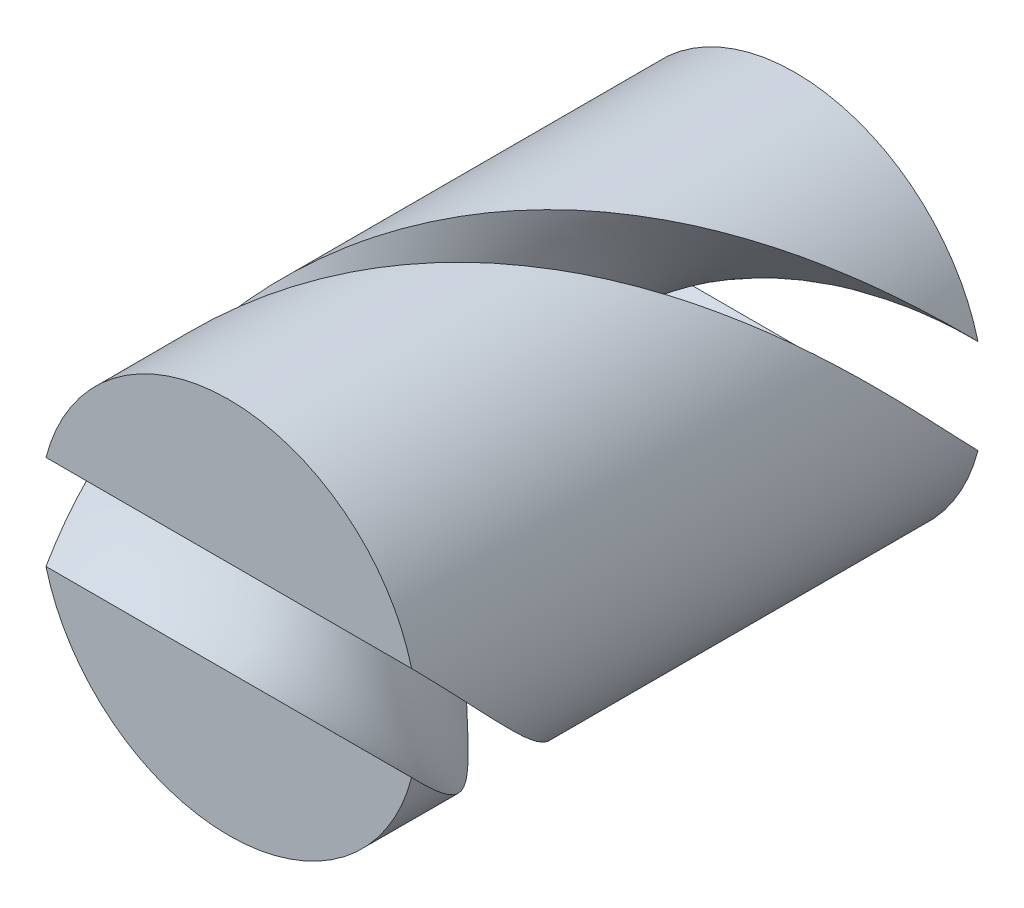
ISO-10303-21;
HEADER;
FILE_DESCRIPTION(('STEP AP214'),'2;1');
FILE_NAME('part.step','',(''),(''),'','','');
FILE_SCHEMA(('AUTOMOTIVE_DESIGN { 1 0 10303 214 1 1 1 1 }'));
ENDSEC;
DATA;
#1=APPLICATION_CONTEXT('core data for automotive mechanical design processes');
#2=APPLICATION_PROTOCOL_DEFINITION('international standard','automotive_design',2000,#1);
#3=PRODUCT_CONTEXT('',#1,'mechanical');
#4=PRODUCT('Part','Part','',(#3));
#5=PRODUCT_RELATED_PRODUCT_CATEGORY('part','',(#4));
#6=PRODUCT_DEFINITION_FORMATION('','',#4);
#7=PRODUCT_DEFINITION_CONTEXT('part definition',#1,'design');
#8=PRODUCT_DEFINITION('design','',#6,#7);
#9=PRODUCT_DEFINITION_SHAPE('','',#8);
#10=(LENGTH_UNIT() NAMED_UNIT(*) SI_UNIT(.MILLI.,.METRE.));
#11=(NAMED_UNIT(*) PLANE_ANGLE_UNIT() SI_UNIT($,.RADIAN.));
#12=(NAMED_UNIT(*) SI_UNIT($,.STERADIAN.) SOLID_ANGLE_UNIT());
#13=UNCERTAINTY_MEASURE_WITH_UNIT(LENGTH_MEASURE(1.E-05),#10,'distance_accuracy_value','');
#14=(GEOMETRIC_REPRESENTATION_CONTEXT(3) GLOBAL_UNCERTAINTY_ASSIGNED_CONTEXT((#13)) GLOBAL_UNIT_ASSIGNED_CONTEXT((#10,
#11,#12)) REPRESENTATION_CONTEXT('',''));
#15=CARTESIAN_POINT('',(0.,0.,0.));
#16=DIRECTION('',(0.,0.,1.));
#17=DIRECTION('',(1.,0.,0.));
#18=AXIS2_PLACEMENT_3D('',#15,#16,#17);
#19=CARTESIAN_POINT('',(0.,0.,150.));
#20=DIRECTION('',(0.,0.,-1.));
#21=DIRECTION('',(-1.,0.,0.));
#22=AXIS2_PLACEMENT_3D('',#19,#20,#21);
#23=CYLINDRICAL_SURFACE('',#22,50.);
#24=CARTESIAN_POINT('',(48.4122918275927,-12.5,0.));
#25=CARTESIAN_POINT('',(50.2095205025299,-5.53936327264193,6.8181818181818));
#26=CARTESIAN_POINT('',(49.9729108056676,1.64565658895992,13.6363636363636));
#27=CARTESIAN_POINT('',(49.7363011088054,8.83067645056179,20.4545454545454));
#28=CARTESIAN_POINT('',(47.4850217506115,15.6579918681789,27.2727272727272));
#29=CARTESIAN_POINT('',(45.2337423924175,22.485307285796,34.090909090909));
#30=CARTESIAN_POINT('',(41.1501786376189,28.4018097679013,40.9090909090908));
#31=CARTESIAN_POINT('',(37.0666148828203,34.3183122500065,47.7272727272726));
#32=CARTESIAN_POINT('',(31.481592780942,38.8446819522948,54.5454545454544));
#33=CARTESIAN_POINT('',(25.8965706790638,43.3710516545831,61.3636363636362));
#34=CARTESIAN_POINT('',(19.2625555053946,46.1405890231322,68.181818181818));
#35=CARTESIAN_POINT('',(12.6285403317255,48.9101263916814,74.9999999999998));
#36=CARTESIAN_POINT('',(5.48298054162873,49.6984599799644,81.8181818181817));
#37=CARTESIAN_POINT('',(-1.66257924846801,50.4867935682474,88.6363636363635));
#38=CARTESIAN_POINT('',(-8.74079289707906,49.230057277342,95.4545454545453));
#39=CARTESIAN_POINT('',(-15.8190065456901,47.9733209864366,102.272727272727));
#40=CARTESIAN_POINT('',(-22.2564392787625,44.7733281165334,109.090909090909));
#41=CARTESIAN_POINT('',(-28.6938720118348,41.5733352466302,115.909090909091));
#42=CARTESIAN_POINT('',(-33.9690013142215,36.6893301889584,122.727272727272));
#43=CARTESIAN_POINT('',(-39.2441306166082,31.8053251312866,129.545454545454));
#44=CARTESIAN_POINT('',(-42.9295968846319,25.6329809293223,136.363636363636));
#45=CARTESIAN_POINT('',(-46.6150631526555,19.4606367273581,143.181818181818));
#46=CARTESIAN_POINT('',(-48.4122918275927,12.5,150.));
#47=CARTESIAN_POINT('',(-50.2095205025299,5.53936327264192,156.818181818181));
#48=CARTESIAN_POINT('',(-49.9729108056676,-1.64565658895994,163.636363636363));
#49=CARTESIAN_POINT('',(-49.7363011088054,-8.83067645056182,170.454545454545));
#50=CARTESIAN_POINT('',(-47.4850217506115,-15.6579918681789,177.272727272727));
#51=CARTESIAN_POINT('',(-45.2337423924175,-22.485307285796,184.090909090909));
#52=CARTESIAN_POINT('',(-41.1501786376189,-28.4018097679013,190.90909090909));
#53=CARTESIAN_POINT('',(-37.0666148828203,-34.3183122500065,197.727272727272));
#54=CARTESIAN_POINT('',(-31.481592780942,-38.8446819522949,204.545454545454));
#55=CARTESIAN_POINT('',(-25.8965706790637,-43.3710516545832,211.363636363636));
#56=CARTESIAN_POINT('',(-19.2625555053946,-46.1405890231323,218.181818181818));
#57=CARTESIAN_POINT('',(-12.6285403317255,-48.9101263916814,225.));
#58=CARTESIAN_POINT('',(-5.48298054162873,-49.6984599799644,231.818181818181));
#59=CARTESIAN_POINT('',(1.662579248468,-50.4867935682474,238.636363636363));
#60=CARTESIAN_POINT('',(8.74079289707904,-49.230057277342,245.454545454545));
#61=CARTESIAN_POINT('',(15.8190065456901,-47.9733209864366,252.272727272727));
#62=CARTESIAN_POINT('',(22.2564392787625,-44.7733281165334,259.090909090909));
#63=CARTESIAN_POINT('',(28.6938720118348,-41.5733352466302,265.90909090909));
#64=CARTESIAN_POINT('',(33.9690013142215,-36.6893301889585,272.727272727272));
#65=CARTESIAN_POINT('',(39.2441306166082,-31.8053251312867,279.545454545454));
#66=CARTESIAN_POINT('',(42.9295968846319,-25.6329809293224,286.363636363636));
#67=CARTESIAN_POINT('',(46.6150631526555,-19.4606367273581,293.181818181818));
#68=CARTESIAN_POINT('',(48.4122918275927,-12.5000000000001,299.999999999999));
#69=(BOUNDED_CURVE() B_SPLINE_CURVE(2,(#24,#25,#26,#27,#28,#29,#30,#31,#32,#33,#34,#35,#36,#37,
#38,#39,#40,#41,#42,#43,#44,#45,#46,#47,#48,#49,#50,#51,#52,#53,#54,#55,#56,#57,#58,#59,#60,#61,
#62,#63,#64,#65,#66,#67,#68),.UNSPECIFIED.,.F.,.F.) B_SPLINE_CURVE_WITH_KNOTS((3,2,2,2,2,2,2,2,
2,2,2,2,2,2,2,2,2,2,2,2,2,2,3),(0.,0.0454545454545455,0.0909090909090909,0.136363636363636,
0.181818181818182,0.227272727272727,0.272727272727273,0.318181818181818,0.363636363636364,
0.409090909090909,0.454545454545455,0.5,0.545454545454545,0.590909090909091,0.636363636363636,
0.681818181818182,0.727272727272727,0.772727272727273,0.818181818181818,0.863636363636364,
0.909090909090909,0.954545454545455,1.),
.UNSPECIFIED.) CURVE() GEOMETRIC_REPRESENTATION_ITEM() RATIONAL_B_SPLINE_CURVE((1.,
0.989821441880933,1.,0.989821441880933,1.,0.989821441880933,1.,0.989821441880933,1.,
0.989821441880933,1.,0.989821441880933,1.,0.989821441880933,1.,0.989821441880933,1.,
0.989821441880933,1.,0.989821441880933,1.,0.989821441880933,1.,0.989821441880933,1.,
0.989821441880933,1.,0.989821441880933,1.,0.989821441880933,1.,0.989821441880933,1.,
0.989821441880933,1.,0.989821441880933,1.,0.989821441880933,1.,0.989821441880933,1.,
0.989821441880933,1.,0.989821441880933,1.)) REPRESENTATION_ITEM(''));
#70=CARTESIAN_POINT('',(48.4122918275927,-12.5,0.));
#71=VERTEX_POINT('',#70);
#72=CARTESIAN_POINT('',(-48.4122918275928,12.4999999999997,150.));
#73=VERTEX_POINT('',#72);
#74=EDGE_CURVE('E56',#71,#73,#69,.T.);
#75=ORIENTED_EDGE('',*,*,#74,.T.);
#76=CARTESIAN_POINT('',(0.,0.,150.));
#77=DIRECTION('',(0.,0.,1.));
#78=DIRECTION('',(1.,0.,0.));
#79=AXIS2_PLACEMENT_3D('',#76,#77,#78);
#80=CIRCLE('',#79,50.);
#81=CARTESIAN_POINT('',(48.4122918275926,12.5000000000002,150.));
#82=VERTEX_POINT('',#81);
#83=EDGE_CURVE('E72',#82,#73,#80,.T.);
#84=ORIENTED_EDGE('',*,*,#83,.F.);
#85=CARTESIAN_POINT('',(-48.4122918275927,-12.5,0.));
#86=CARTESIAN_POINT('',(-46.6150631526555,-19.4606367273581,6.8181818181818));
#87=CARTESIAN_POINT('',(-42.9295968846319,-25.6329809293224,13.6363636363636));
#88=CARTESIAN_POINT('',(-39.2441306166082,-31.8053251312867,20.4545454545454));
#89=CARTESIAN_POINT('',(-33.9690013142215,-36.6893301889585,27.2727272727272));
#90=CARTESIAN_POINT('',(-28.6938720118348,-41.5733352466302,34.090909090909));
#91=CARTESIAN_POINT('',(-22.2564392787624,-44.7733281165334,40.9090909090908));
#92=CARTESIAN_POINT('',(-15.8190065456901,-47.9733209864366,47.7272727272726));
#93=CARTESIAN_POINT('',(-8.74079289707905,-49.230057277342,54.5454545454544));
#94=CARTESIAN_POINT('',(-1.662579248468,-50.4867935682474,61.3636363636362));
#95=CARTESIAN_POINT('',(5.48298054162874,-49.6984599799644,68.181818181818));
#96=CARTESIAN_POINT('',(12.6285403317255,-48.9101263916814,74.9999999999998));
#97=CARTESIAN_POINT('',(19.2625555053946,-46.1405890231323,81.8181818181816));
#98=CARTESIAN_POINT('',(25.8965706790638,-43.3710516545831,88.6363636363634));
#99=CARTESIAN_POINT('',(31.481592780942,-38.8446819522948,95.4545454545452));
#100=CARTESIAN_POINT('',(37.0666148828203,-34.3183122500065,102.272727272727));
#101=CARTESIAN_POINT('',(41.1501786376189,-28.4018097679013,109.090909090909));
#102=CARTESIAN_POINT('',(45.2337423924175,-22.485307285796,115.909090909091));
#103=CARTESIAN_POINT('',(47.4850217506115,-15.6579918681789,122.727272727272));
#104=CARTESIAN_POINT('',(49.7363011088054,-8.83067645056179,129.545454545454));
#105=CARTESIAN_POINT('',(49.9729108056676,-1.64565658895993,136.363636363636));
#106=CARTESIAN_POINT('',(50.2095205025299,5.53936327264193,143.181818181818));
#107=CARTESIAN_POINT('',(48.4122918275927,12.5,150.));
#108=CARTESIAN_POINT('',(46.6150631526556,19.4606367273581,156.818181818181));
#109=CARTESIAN_POINT('',(42.9295968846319,25.6329809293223,163.636363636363));
#110=CARTESIAN_POINT('',(39.2441306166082,31.8053251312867,170.454545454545));
#111=CARTESIAN_POINT('',(33.9690013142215,36.6893301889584,177.272727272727));
#112=CARTESIAN_POINT('',(28.6938720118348,41.5733352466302,184.090909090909));
#113=CARTESIAN_POINT('',(22.2564392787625,44.7733281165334,190.90909090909));
#114=CARTESIAN_POINT('',(15.8190065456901,47.9733209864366,197.727272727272));
#115=CARTESIAN_POINT('',(8.74079289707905,49.230057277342,204.545454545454));
#116=CARTESIAN_POINT('',(1.662579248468,50.4867935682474,211.363636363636));
#117=CARTESIAN_POINT('',(-5.48298054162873,49.6984599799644,218.181818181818));
#118=CARTESIAN_POINT('',(-12.6285403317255,48.9101263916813,225.));
#119=CARTESIAN_POINT('',(-19.2625555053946,46.1405890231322,231.818181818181));
#120=CARTESIAN_POINT('',(-25.8965706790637,43.3710516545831,238.636363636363));
#121=CARTESIAN_POINT('',(-31.481592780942,38.8446819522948,245.454545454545));
#122=CARTESIAN_POINT('',(-37.0666148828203,34.3183122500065,252.272727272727));
#123=CARTESIAN_POINT('',(-41.1501786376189,28.4018097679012,259.090909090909));
#124=CARTESIAN_POINT('',(-45.2337423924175,22.485307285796,265.90909090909));
#125=CARTESIAN_POINT('',(-47.4850217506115,15.6579918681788,272.727272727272));
#126=CARTESIAN_POINT('',(-49.7363011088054,8.83067645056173,279.545454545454));
#127=CARTESIAN_POINT('',(-49.9729108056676,1.64565658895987,286.363636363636));
#128=CARTESIAN_POINT('',(-50.2095205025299,-5.53936327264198,293.181818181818));
#129=CARTESIAN_POINT('',(-48.4122918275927,-12.5,299.999999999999));
#130=(BOUNDED_CURVE() B_SPLINE_CURVE(2,(#85,#86,#87,#88,#89,#90,#91,#92,#93,#94,#95,#96,#97,#98,
#99,#100,#101,#102,#103,#104,#105,#106,#107,#108,#109,#110,#111,#112,#113,#114,#115,#116,#117,
#118,#119,#120,#121,#122,#123,#124,#125,#126,#127,#128,#129),.UNSPECIFIED.,.F.,
.F.) B_SPLINE_CURVE_WITH_KNOTS((3,2,2,2,2,2,2,2,2,2,2,2,2,2,2,2,2,2,2,2,2,2,3),(0.,
0.0454545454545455,0.0909090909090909,0.136363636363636,0.181818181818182,0.227272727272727,
0.272727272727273,0.318181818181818,0.363636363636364,0.409090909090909,0.454545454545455,0.5,
0.545454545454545,0.590909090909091,0.636363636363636,0.681818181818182,0.727272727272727,
0.772727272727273,0.818181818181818,0.863636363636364,0.909090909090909,0.954545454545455,1.),
.UNSPECIFIED.) CURVE() GEOMETRIC_REPRESENTATION_ITEM() RATIONAL_B_SPLINE_CURVE((1.,
0.989821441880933,1.,0.989821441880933,1.,0.989821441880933,1.,0.989821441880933,1.,
0.989821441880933,1.,0.989821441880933,1.,0.989821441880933,1.,0.989821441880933,1.,
0.989821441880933,1.,0.989821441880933,1.,0.989821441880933,1.,0.989821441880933,1.,
0.989821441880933,1.,0.989821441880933,1.,0.989821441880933,1.,0.989821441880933,1.,
0.989821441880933,1.,0.989821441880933,1.,0.989821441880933,1.,0.989821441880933,1.,
0.989821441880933,1.,0.989821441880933,1.)) REPRESENTATION_ITEM(''));
#131=CARTESIAN_POINT('',(-48.4122918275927,-12.5,0.));
#132=VERTEX_POINT('',#131);
#133=EDGE_CURVE('E44',#132,#82,#130,.T.);
#134=ORIENTED_EDGE('',*,*,#133,.F.);
#135=CARTESIAN_POINT('',(0.,0.,0.));
#136=DIRECTION('',(0.,0.,1.));
#137=DIRECTION('',(1.,0.,0.));
#138=AXIS2_PLACEMENT_3D('',#135,#136,#137);
#139=CIRCLE('',#138,50.);
#140=EDGE_CURVE('E76',#132,#71,#139,.T.);
#141=ORIENTED_EDGE('',*,*,#140,.T.);
#142=EDGE_LOOP('',(#75,#84,#134,#141));
#143=FACE_BOUND('',#142,.T.);
#144=ADVANCED_FACE('F36',(#143),#23,.T.);
#145=CARTESIAN_POINT('',(0.,0.,150.));
#146=DIRECTION('',(0.,0.,1.));
#147=DIRECTION('',(1.,0.,0.));
#148=AXIS2_PLACEMENT_3D('',#145,#146,#147);
#149=PLANE('',#148);
#150=ORIENTED_EDGE('',*,*,#83,.T.);
#151=DIRECTION('',(1.,0.,0.));
#152=VECTOR('',#151,1.);
#153=CARTESIAN_POINT('',(-48.4122918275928,12.4999999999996,150.));
#154=LINE('',#153,#152);
#155=EDGE_CURVE('E61',#73,#82,#154,.T.);
#156=ORIENTED_EDGE('',*,*,#155,.T.);
#157=EDGE_LOOP('',(#150,#156));
#158=FACE_BOUND('',#157,.T.);
#159=ADVANCED_FACE('F71',(#158),#149,.T.);
#160=CARTESIAN_POINT('',(0.,0.,0.));
#161=DIRECTION('',(0.,0.,1.));
#162=DIRECTION('',(1.,0.,0.));
#163=AXIS2_PLACEMENT_3D('',#160,#161,#162);
#164=PLANE('',#163);
#165=DIRECTION('',(-1.,0.,0.));
#166=VECTOR('',#165,1.);
#167=CARTESIAN_POINT('',(48.4122918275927,-12.5,0.));
#168=LINE('',#167,#166);
#169=EDGE_CURVE('E12',#71,#132,#168,.T.);
#170=ORIENTED_EDGE('',*,*,#169,.F.);
#171=ORIENTED_EDGE('',*,*,#140,.F.);
#172=EDGE_LOOP('',(#170,#171));
#173=FACE_BOUND('',#172,.T.);
#174=ADVANCED_FACE('F110',(#173),#164,.F.);
#175=CARTESIAN_POINT('',(48.4122918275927,-12.5,0.));
#176=CARTESIAN_POINT('',(50.2095205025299,-5.53936327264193,6.8181818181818));
#177=CARTESIAN_POINT('',(49.9729108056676,1.64565658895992,13.6363636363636));
#178=CARTESIAN_POINT('',(49.7363011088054,8.83067645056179,20.4545454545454));
#179=CARTESIAN_POINT('',(47.4850217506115,15.6579918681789,27.2727272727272));
#180=CARTESIAN_POINT('',(45.2337423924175,22.485307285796,34.090909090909));
#181=CARTESIAN_POINT('',(41.1501786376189,28.4018097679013,40.9090909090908));
#182=CARTESIAN_POINT('',(37.0666148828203,34.3183122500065,47.7272727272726));
#183=CARTESIAN_POINT('',(31.481592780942,38.8446819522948,54.5454545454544));
#184=CARTESIAN_POINT('',(25.8965706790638,43.3710516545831,61.3636363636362));
#185=CARTESIAN_POINT('',(19.2625555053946,46.1405890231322,68.181818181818));
#186=CARTESIAN_POINT('',(12.6285403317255,48.9101263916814,74.9999999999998));
#187=CARTESIAN_POINT('',(5.48298054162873,49.6984599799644,81.8181818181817));
#188=CARTESIAN_POINT('',(-1.66257924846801,50.4867935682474,88.6363636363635));
#189=CARTESIAN_POINT('',(-8.74079289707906,49.230057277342,95.4545454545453));
#190=CARTESIAN_POINT('',(-15.8190065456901,47.9733209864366,102.272727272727));
#191=CARTESIAN_POINT('',(-22.2564392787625,44.7733281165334,109.090909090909));
#192=CARTESIAN_POINT('',(-28.6938720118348,41.5733352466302,115.909090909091));
#193=CARTESIAN_POINT('',(-33.9690013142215,36.6893301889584,122.727272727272));
#194=CARTESIAN_POINT('',(-39.2441306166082,31.8053251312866,129.545454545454));
#195=CARTESIAN_POINT('',(-42.9295968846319,25.6329809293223,136.363636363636));
#196=CARTESIAN_POINT('',(-46.6150631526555,19.4606367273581,143.181818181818));
#197=CARTESIAN_POINT('',(-48.4122918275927,12.5,150.));
#198=CARTESIAN_POINT('',(-50.2095205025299,5.53936327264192,156.818181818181));
#199=CARTESIAN_POINT('',(-49.9729108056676,-1.64565658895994,163.636363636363));
#200=CARTESIAN_POINT('',(-49.7363011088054,-8.83067645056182,170.454545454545));
#201=CARTESIAN_POINT('',(-47.4850217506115,-15.6579918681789,177.272727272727));
#202=CARTESIAN_POINT('',(-45.2337423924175,-22.485307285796,184.090909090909));
#203=CARTESIAN_POINT('',(-41.1501786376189,-28.4018097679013,190.90909090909));
#204=CARTESIAN_POINT('',(-37.0666148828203,-34.3183122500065,197.727272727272));
#205=CARTESIAN_POINT('',(-31.481592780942,-38.8446819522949,204.545454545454));
#206=CARTESIAN_POINT('',(-25.8965706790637,-43.3710516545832,211.363636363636));
#207=CARTESIAN_POINT('',(-19.2625555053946,-46.1405890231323,218.181818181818));
#208=CARTESIAN_POINT('',(-12.6285403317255,-48.9101263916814,225.));
#209=CARTESIAN_POINT('',(-5.48298054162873,-49.6984599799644,231.818181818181));
#210=CARTESIAN_POINT('',(1.662579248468,-50.4867935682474,238.636363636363));
#211=CARTESIAN_POINT('',(8.74079289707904,-49.230057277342,245.454545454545));
#212=CARTESIAN_POINT('',(15.8190065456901,-47.9733209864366,252.272727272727));
#213=CARTESIAN_POINT('',(22.2564392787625,-44.7733281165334,259.090909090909));
#214=CARTESIAN_POINT('',(28.6938720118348,-41.5733352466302,265.90909090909));
#215=CARTESIAN_POINT('',(33.9690013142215,-36.6893301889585,272.727272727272));
#216=CARTESIAN_POINT('',(39.2441306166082,-31.8053251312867,279.545454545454));
#217=CARTESIAN_POINT('',(42.9295968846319,-25.6329809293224,286.363636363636));
#218=CARTESIAN_POINT('',(46.6150631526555,-19.4606367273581,293.181818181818));
#219=CARTESIAN_POINT('',(48.4122918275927,-12.5,299.999999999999));
#220=CARTESIAN_POINT('',(-48.4122918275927,-12.5,0.));
#221=CARTESIAN_POINT('',(-46.6150631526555,-19.4606367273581,6.8181818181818));
#222=CARTESIAN_POINT('',(-42.9295968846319,-25.6329809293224,13.6363636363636));
#223=CARTESIAN_POINT('',(-39.2441306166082,-31.8053251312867,20.4545454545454));
#224=CARTESIAN_POINT('',(-33.9690013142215,-36.6893301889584,27.2727272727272));
#225=CARTESIAN_POINT('',(-28.6938720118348,-41.5733352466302,34.090909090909));
#226=CARTESIAN_POINT('',(-22.2564392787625,-44.7733281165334,40.9090909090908));
#227=CARTESIAN_POINT('',(-15.8190065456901,-47.9733209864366,47.7272727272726));
#228=CARTESIAN_POINT('',(-8.74079289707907,-49.230057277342,54.5454545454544));
#229=CARTESIAN_POINT('',(-1.66257924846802,-50.4867935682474,61.3636363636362));
#230=CARTESIAN_POINT('',(5.48298054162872,-49.6984599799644,68.181818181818));
#231=CARTESIAN_POINT('',(12.6285403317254,-48.9101263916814,74.9999999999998));
#232=CARTESIAN_POINT('',(19.2625555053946,-46.1405890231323,81.8181818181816));
#233=CARTESIAN_POINT('',(25.8965706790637,-43.3710516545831,88.6363636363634));
#234=CARTESIAN_POINT('',(31.481592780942,-38.8446819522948,95.4545454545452));
#235=CARTESIAN_POINT('',(37.0666148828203,-34.3183122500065,102.272727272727));
#236=CARTESIAN_POINT('',(41.1501786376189,-28.4018097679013,109.090909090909));
#237=CARTESIAN_POINT('',(45.2337423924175,-22.4853072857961,115.909090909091));
#238=CARTESIAN_POINT('',(47.4850217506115,-15.6579918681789,122.727272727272));
#239=CARTESIAN_POINT('',(49.7363011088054,-8.8306764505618,129.545454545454));
#240=CARTESIAN_POINT('',(49.9729108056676,-1.64565658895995,136.363636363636));
#241=CARTESIAN_POINT('',(50.2095205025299,5.53936327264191,143.181818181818));
#242=CARTESIAN_POINT('',(48.4122918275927,12.5,150.));
#243=CARTESIAN_POINT('',(46.6150631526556,19.460636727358,156.818181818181));
#244=CARTESIAN_POINT('',(42.9295968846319,25.6329809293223,163.636363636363));
#245=CARTESIAN_POINT('',(39.2441306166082,31.8053251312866,170.454545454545));
#246=CARTESIAN_POINT('',(33.9690013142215,36.6893301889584,177.272727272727));
#247=CARTESIAN_POINT('',(28.6938720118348,41.5733352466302,184.090909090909));
#248=CARTESIAN_POINT('',(22.2564392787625,44.7733281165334,190.90909090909));
#249=CARTESIAN_POINT('',(15.8190065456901,47.9733209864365,197.727272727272));
#250=CARTESIAN_POINT('',(8.74079289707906,49.230057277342,204.545454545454));
#251=CARTESIAN_POINT('',(1.66257924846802,50.4867935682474,211.363636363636));
#252=CARTESIAN_POINT('',(-5.48298054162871,49.6984599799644,218.181818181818));
#253=CARTESIAN_POINT('',(-12.6285403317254,48.9101263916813,225.));
#254=CARTESIAN_POINT('',(-19.2625555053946,46.1405890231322,231.818181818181));
#255=CARTESIAN_POINT('',(-25.8965706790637,43.3710516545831,238.636363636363));
#256=CARTESIAN_POINT('',(-31.481592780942,38.8446819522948,245.454545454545));
#257=CARTESIAN_POINT('',(-37.0666148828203,34.3183122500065,252.272727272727));
#258=CARTESIAN_POINT('',(-41.1501786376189,28.4018097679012,259.090909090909));
#259=CARTESIAN_POINT('',(-45.2337423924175,22.485307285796,265.90909090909));
#260=CARTESIAN_POINT('',(-47.4850217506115,15.6579918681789,272.727272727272));
#261=CARTESIAN_POINT('',(-49.7363011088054,8.83067645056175,279.545454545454));
#262=CARTESIAN_POINT('',(-49.9729108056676,1.64565658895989,286.363636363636));
#263=CARTESIAN_POINT('',(-50.2095205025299,-5.53936327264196,293.181818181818));
#264=CARTESIAN_POINT('',(-48.4122918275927,-12.5,299.999999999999));
#265=(BOUNDED_SURFACE() B_SPLINE_SURFACE(1,2,((#175,#176,#177,#178,#179,#180,#181,#182,#183,
#184,#185,#186,#187,#188,#189,#190,#191,#192,#193,#194,#195,#196,#197,#198,#199,#200,#201,#202,
#203,#204,#205,#206,#207,#208,#209,#210,#211,#212,#213,#214,#215,#216,#217,#218,#219),(#220,
#221,#222,#223,#224,#225,#226,#227,#228,#229,#230,#231,#232,#233,#234,#235,#236,#237,#238,#239,
#240,#241,#242,#243,#244,#245,#246,#247,#248,#249,#250,#251,#252,#253,#254,#255,#256,#257,#258,
#259,#260,#261,#262,#263,#264)),.UNSPECIFIED.,.F.,.F.,.F.) B_SPLINE_SURFACE_WITH_KNOTS((2,2),(3,
2,2,2,2,2,2,2,2,2,2,2,2,2,2,2,2,2,2,2,2,2,3),(0.,1.),(0.,0.0454545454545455,0.0909090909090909,
0.136363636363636,0.181818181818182,0.227272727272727,0.272727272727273,0.318181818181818,
0.363636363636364,0.409090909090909,0.454545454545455,0.5,0.545454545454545,0.590909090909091,
0.636363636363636,0.681818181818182,0.727272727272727,0.772727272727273,0.818181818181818,
0.863636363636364,0.909090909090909,0.954545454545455,1.),
.UNSPECIFIED.) GEOMETRIC_REPRESENTATION_ITEM() RATIONAL_B_SPLINE_SURFACE(((1.,0.989821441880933,
1.,0.989821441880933,1.,0.989821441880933,1.,0.989821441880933,1.,0.989821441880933,1.,
0.989821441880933,1.,0.989821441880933,1.,0.989821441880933,1.,0.989821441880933,1.,
0.989821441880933,1.,0.989821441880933,1.,0.989821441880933,1.,0.989821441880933,1.,
0.989821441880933,1.,0.989821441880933,1.,0.989821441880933,1.,0.989821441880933,1.,
0.989821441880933,1.,0.989821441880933,1.,0.989821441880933,1.,0.989821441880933,1.,
0.989821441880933,1.),(1.,0.989821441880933,1.,0.989821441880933,1.,0.989821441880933,1.,
0.989821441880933,1.,0.989821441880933,1.,0.989821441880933,1.,0.989821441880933,1.,
0.989821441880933,1.,0.989821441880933,1.,0.989821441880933,1.,0.989821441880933,1.,
0.989821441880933,1.,0.989821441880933,1.,0.989821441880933,1.,0.989821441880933,1.,
0.989821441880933,1.,0.989821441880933,1.,0.989821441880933,1.,0.989821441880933,1.,
0.989821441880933,1.,0.989821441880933,1.,0.989821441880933,1.))) REPRESENTATION_ITEM('') SURFACE());
#266=ORIENTED_EDGE('',*,*,#133,.T.);
#267=ORIENTED_EDGE('',*,*,#155,.F.);
#268=ORIENTED_EDGE('',*,*,#74,.F.);
#269=ORIENTED_EDGE('',*,*,#169,.T.);
#270=EDGE_LOOP('',(#266,#267,#268,#269));
#271=FACE_BOUND('',#270,.T.);
#272=ADVANCED_FACE('F60',(#271),#265,.T.);
#273=CLOSED_SHELL('',(#144,#159,#174,#272));
#274=MANIFOLD_SOLID_BREP('B2',#273);
#275=CARTESIAN_POINT('',(0.,0.,0.));
#276=DIRECTION('',(0.,0.,1.));
#277=DIRECTION('',(1.,0.,0.));
#278=AXIS2_PLACEMENT_3D('',#275,#276,#277);
#279=PLANE('',#278);
#280=DIRECTION('',(1.,0.,0.));
#281=VECTOR('',#280,1.);
#282=CARTESIAN_POINT('',(48.4122918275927,12.5,0.));
#283=LINE('',#282,#281);
#284=CARTESIAN_POINT('',(-48.4122918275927,12.5,0.));
#285=VERTEX_POINT('',#284);
#286=CARTESIAN_POINT('',(48.4122918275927,12.5,0.));
#287=VERTEX_POINT('',#286);
#288=EDGE_CURVE('E175',#285,#287,#283,.T.);
#289=ORIENTED_EDGE('',*,*,#288,.F.);
#290=CARTESIAN_POINT('',(0.,0.,0.));
#291=DIRECTION('',(0.,0.,1.));
#292=DIRECTION('',(1.,0.,0.));
#293=AXIS2_PLACEMENT_3D('',#290,#291,#292);
#294=CIRCLE('',#293,50.);
#295=EDGE_CURVE('E158',#287,#285,#294,.T.);
#296=ORIENTED_EDGE('',*,*,#295,.F.);
#297=EDGE_LOOP('',(#289,#296));
#298=FACE_BOUND('',#297,.T.);
#299=ADVANCED_FACE('F148',(#298),#279,.F.);
#300=CARTESIAN_POINT('',(0.,0.,150.));
#301=DIRECTION('',(0.,0.,1.));
#302=DIRECTION('',(1.,0.,0.));
#303=AXIS2_PLACEMENT_3D('',#300,#301,#302);
#304=PLANE('',#303);
#305=CARTESIAN_POINT('',(0.,0.,150.));
#306=DIRECTION('',(0.,0.,1.));
#307=DIRECTION('',(1.,0.,0.));
#308=AXIS2_PLACEMENT_3D('',#305,#306,#307);
#309=CIRCLE('',#308,50.);
#310=CARTESIAN_POINT('',(-48.4122918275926,-12.5000000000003,150.));
#311=VERTEX_POINT('',#310);
#312=CARTESIAN_POINT('',(48.4122918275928,-12.4999999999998,150.));
#313=VERTEX_POINT('',#312);
#314=EDGE_CURVE('E34',#311,#313,#309,.T.);
#315=ORIENTED_EDGE('',*,*,#314,.T.);
#316=DIRECTION('',(-1.,0.,0.));
#317=VECTOR('',#316,1.);
#318=CARTESIAN_POINT('',(-48.4122918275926,-12.5000000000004,150.));
#319=LINE('',#318,#317);
#320=EDGE_CURVE('E152',#313,#311,#319,.T.);
#321=ORIENTED_EDGE('',*,*,#320,.T.);
#322=EDGE_LOOP('',(#315,#321));
#323=FACE_BOUND('',#322,.T.);
#324=ADVANCED_FACE('F197',(#323),#304,.T.);
#325=CARTESIAN_POINT('',(0.,0.,150.));
#326=DIRECTION('',(0.,0.,-1.));
#327=DIRECTION('',(-1.,0.,0.));
#328=AXIS2_PLACEMENT_3D('',#325,#326,#327);
#329=CYLINDRICAL_SURFACE('',#328,50.);
#330=CARTESIAN_POINT('',(-48.4122918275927,12.5,0.));
#331=CARTESIAN_POINT('',(-50.2095205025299,5.53936327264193,6.8181818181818));
#332=CARTESIAN_POINT('',(-49.9729108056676,-1.64565658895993,13.6363636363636));
#333=CARTESIAN_POINT('',(-49.7363011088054,-8.83067645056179,20.4545454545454));
#334=CARTESIAN_POINT('',(-47.4850217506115,-15.6579918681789,27.2727272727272));
#335=CARTESIAN_POINT('',(-45.2337423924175,-22.485307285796,34.090909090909));
#336=CARTESIAN_POINT('',(-41.1501786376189,-28.4018097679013,40.9090909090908));
#337=CARTESIAN_POINT('',(-37.0666148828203,-34.3183122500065,47.7272727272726));
#338=CARTESIAN_POINT('',(-31.481592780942,-38.8446819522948,54.5454545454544));
#339=CARTESIAN_POINT('',(-25.8965706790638,-43.3710516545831,61.3636363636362));
#340=CARTESIAN_POINT('',(-19.2625555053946,-46.1405890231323,68.181818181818));
#341=CARTESIAN_POINT('',(-12.6285403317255,-48.9101263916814,74.9999999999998));
#342=CARTESIAN_POINT('',(-5.48298054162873,-49.6984599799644,81.8181818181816));
#343=CARTESIAN_POINT('',(1.66257924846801,-50.4867935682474,88.6363636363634));
#344=CARTESIAN_POINT('',(8.74079289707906,-49.230057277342,95.4545454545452));
#345=CARTESIAN_POINT('',(15.8190065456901,-47.9733209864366,102.272727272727));
#346=CARTESIAN_POINT('',(22.2564392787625,-44.7733281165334,109.090909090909));
#347=CARTESIAN_POINT('',(28.6938720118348,-41.5733352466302,115.909090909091));
#348=CARTESIAN_POINT('',(33.9690013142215,-36.6893301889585,122.727272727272));
#349=CARTESIAN_POINT('',(39.2441306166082,-31.8053251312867,129.545454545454));
#350=CARTESIAN_POINT('',(42.9295968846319,-25.6329809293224,136.363636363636));
#351=CARTESIAN_POINT('',(46.6150631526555,-19.4606367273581,143.181818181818));
#352=CARTESIAN_POINT('',(48.4122918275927,-12.5,150.));
#353=CARTESIAN_POINT('',(50.2095205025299,-5.53936327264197,156.818181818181));
#354=CARTESIAN_POINT('',(49.9729108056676,1.64565658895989,163.636363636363));
#355=CARTESIAN_POINT('',(49.7363011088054,8.83067645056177,170.454545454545));
#356=CARTESIAN_POINT('',(47.4850217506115,15.6579918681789,177.272727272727));
#357=CARTESIAN_POINT('',(45.2337423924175,22.485307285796,184.090909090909));
#358=CARTESIAN_POINT('',(41.1501786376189,28.4018097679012,190.90909090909));
#359=CARTESIAN_POINT('',(37.0666148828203,34.3183122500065,197.727272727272));
#360=CARTESIAN_POINT('',(31.481592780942,38.8446819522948,204.545454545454));
#361=CARTESIAN_POINT('',(25.8965706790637,43.3710516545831,211.363636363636));
#362=CARTESIAN_POINT('',(19.2625555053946,46.1405890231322,218.181818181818));
#363=CARTESIAN_POINT('',(12.6285403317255,48.9101263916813,225.));
#364=CARTESIAN_POINT('',(5.48298054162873,49.6984599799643,231.818181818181));
#365=CARTESIAN_POINT('',(-1.662579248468,50.4867935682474,238.636363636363));
#366=CARTESIAN_POINT('',(-8.74079289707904,49.230057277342,245.454545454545));
#367=CARTESIAN_POINT('',(-15.8190065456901,47.9733209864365,252.272727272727));
#368=CARTESIAN_POINT('',(-22.2564392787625,44.7733281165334,259.090909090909));
#369=CARTESIAN_POINT('',(-28.6938720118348,41.5733352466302,265.90909090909));
#370=CARTESIAN_POINT('',(-33.9690013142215,36.6893301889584,272.727272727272));
#371=CARTESIAN_POINT('',(-39.2441306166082,31.8053251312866,279.545454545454));
#372=CARTESIAN_POINT('',(-42.9295968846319,25.6329809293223,286.363636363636));
#373=CARTESIAN_POINT('',(-46.6150631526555,19.460636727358,293.181818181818));
#374=CARTESIAN_POINT('',(-48.4122918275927,12.5,299.999999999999));
#375=(BOUNDED_CURVE() B_SPLINE_CURVE(2,(#330,#331,#332,#333,#334,#335,#336,#337,#338,#339,#340,
#341,#342,#343,#344,#345,#346,#347,#348,#349,#350,#351,#352,#353,#354,#355,#356,#357,#358,#359,
#360,#361,#362,#363,#364,#365,#366,#367,#368,#369,#370,#371,#372,#373,#374),.UNSPECIFIED.,.F.,
.F.) B_SPLINE_CURVE_WITH_KNOTS((3,2,2,2,2,2,2,2,2,2,2,2,2,2,2,2,2,2,2,2,2,2,3),(0.,
0.0454545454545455,0.0909090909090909,0.136363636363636,0.181818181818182,0.227272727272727,
0.272727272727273,0.318181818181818,0.363636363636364,0.409090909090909,0.454545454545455,0.5,
0.545454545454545,0.590909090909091,0.636363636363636,0.681818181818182,0.727272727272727,
0.772727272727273,0.818181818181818,0.863636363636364,0.909090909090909,0.954545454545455,1.),
.UNSPECIFIED.) CURVE() GEOMETRIC_REPRESENTATION_ITEM() RATIONAL_B_SPLINE_CURVE((1.,
0.989821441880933,1.,0.989821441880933,1.,0.989821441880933,1.,0.989821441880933,1.,
0.989821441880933,1.,0.989821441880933,1.,0.989821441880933,1.,0.989821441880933,1.,
0.989821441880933,1.,0.989821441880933,1.,0.989821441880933,1.,0.989821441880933,1.,
0.989821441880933,1.,0.989821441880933,1.,0.989821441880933,1.,0.989821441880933,1.,
0.989821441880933,1.,0.989821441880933,1.,0.989821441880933,1.,0.989821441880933,1.,
0.989821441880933,1.,0.989821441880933,1.)) REPRESENTATION_ITEM(''));
#376=EDGE_CURVE('E166',#285,#313,#375,.T.);
#377=ORIENTED_EDGE('',*,*,#376,.T.);
#378=ORIENTED_EDGE('',*,*,#314,.F.);
#379=CARTESIAN_POINT('',(48.4122918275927,12.5,0.));
#380=CARTESIAN_POINT('',(46.6150631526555,19.4606367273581,6.8181818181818));
#381=CARTESIAN_POINT('',(42.9295968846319,25.6329809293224,13.6363636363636));
#382=CARTESIAN_POINT('',(39.2441306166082,31.8053251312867,20.4545454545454));
#383=CARTESIAN_POINT('',(33.9690013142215,36.6893301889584,27.2727272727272));
#384=CARTESIAN_POINT('',(28.6938720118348,41.5733352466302,34.090909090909));
#385=CARTESIAN_POINT('',(22.2564392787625,44.7733281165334,40.9090909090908));
#386=CARTESIAN_POINT('',(15.8190065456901,47.9733209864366,47.7272727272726));
#387=CARTESIAN_POINT('',(8.74079289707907,49.230057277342,54.5454545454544));
#388=CARTESIAN_POINT('',(1.66257924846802,50.4867935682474,61.3636363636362));
#389=CARTESIAN_POINT('',(-5.48298054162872,49.6984599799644,68.181818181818));
#390=CARTESIAN_POINT('',(-12.6285403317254,48.9101263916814,74.9999999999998));
#391=CARTESIAN_POINT('',(-19.2625555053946,46.1405890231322,81.8181818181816));
#392=CARTESIAN_POINT('',(-25.8965706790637,43.3710516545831,88.6363636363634));
#393=CARTESIAN_POINT('',(-31.481592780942,38.8446819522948,95.4545454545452));
#394=CARTESIAN_POINT('',(-37.0666148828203,34.3183122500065,102.272727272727));
#395=CARTESIAN_POINT('',(-41.1501786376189,28.4018097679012,109.090909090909));
#396=CARTESIAN_POINT('',(-45.2337423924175,22.485307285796,115.909090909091));
#397=CARTESIAN_POINT('',(-47.4850217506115,15.6579918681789,122.727272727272));
#398=CARTESIAN_POINT('',(-49.7363011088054,8.83067645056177,129.545454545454));
#399=CARTESIAN_POINT('',(-49.9729108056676,1.64565658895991,136.363636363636));
#400=CARTESIAN_POINT('',(-50.2095205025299,-5.53936327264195,143.181818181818));
#401=CARTESIAN_POINT('',(-48.4122918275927,-12.5,150.));
#402=CARTESIAN_POINT('',(-46.6150631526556,-19.4606367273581,156.818181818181));
#403=CARTESIAN_POINT('',(-42.9295968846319,-25.6329809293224,163.636363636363));
#404=CARTESIAN_POINT('',(-39.2441306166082,-31.8053251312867,170.454545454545));
#405=CARTESIAN_POINT('',(-33.9690013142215,-36.6893301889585,177.272727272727));
#406=CARTESIAN_POINT('',(-28.6938720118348,-41.5733352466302,184.090909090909));
#407=CARTESIAN_POINT('',(-22.2564392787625,-44.7733281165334,190.90909090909));
#408=CARTESIAN_POINT('',(-15.8190065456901,-47.9733209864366,197.727272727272));
#409=CARTESIAN_POINT('',(-8.74079289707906,-49.230057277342,204.545454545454));
#410=CARTESIAN_POINT('',(-1.66257924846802,-50.4867935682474,211.363636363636));
#411=CARTESIAN_POINT('',(5.48298054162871,-49.6984599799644,218.181818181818));
#412=CARTESIAN_POINT('',(12.6285403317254,-48.9101263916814,225.));
#413=CARTESIAN_POINT('',(19.2625555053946,-46.1405890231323,231.818181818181));
#414=CARTESIAN_POINT('',(25.8965706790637,-43.3710516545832,238.636363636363));
#415=CARTESIAN_POINT('',(31.481592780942,-38.8446819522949,245.454545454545));
#416=CARTESIAN_POINT('',(37.0666148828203,-34.3183122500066,252.272727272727));
#417=CARTESIAN_POINT('',(41.1501786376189,-28.4018097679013,259.090909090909));
#418=CARTESIAN_POINT('',(45.2337423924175,-22.4853072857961,265.90909090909));
#419=CARTESIAN_POINT('',(47.4850217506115,-15.6579918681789,272.727272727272));
#420=CARTESIAN_POINT('',(49.7363011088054,-8.83067645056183,279.545454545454));
#421=CARTESIAN_POINT('',(49.9729108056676,-1.64565658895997,286.363636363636));
#422=CARTESIAN_POINT('',(50.2095205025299,5.53936327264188,293.181818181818));
#423=CARTESIAN_POINT('',(48.4122918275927,12.4999999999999,299.999999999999));
#424=(BOUNDED_CURVE() B_SPLINE_CURVE(2,(#379,#380,#381,#382,#383,#384,#385,#386,#387,#388,#389,
#390,#391,#392,#393,#394,#395,#396,#397,#398,#399,#400,#401,#402,#403,#404,#405,#406,#407,#408,
#409,#410,#411,#412,#413,#414,#415,#416,#417,#418,#419,#420,#421,#422,#423),.UNSPECIFIED.,.F.,
.F.) B_SPLINE_CURVE_WITH_KNOTS((3,2,2,2,2,2,2,2,2,2,2,2,2,2,2,2,2,2,2,2,2,2,3),(0.,
0.0454545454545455,0.0909090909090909,0.136363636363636,0.181818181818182,0.227272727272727,
0.272727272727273,0.318181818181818,0.363636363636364,0.409090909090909,0.454545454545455,0.5,
0.545454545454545,0.590909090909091,0.636363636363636,0.681818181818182,0.727272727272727,
0.772727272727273,0.818181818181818,0.863636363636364,0.909090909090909,0.954545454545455,1.),
.UNSPECIFIED.) CURVE() GEOMETRIC_REPRESENTATION_ITEM() RATIONAL_B_SPLINE_CURVE((1.,
0.989821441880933,1.,0.989821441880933,1.,0.989821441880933,1.,0.989821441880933,1.,
0.989821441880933,1.,0.989821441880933,1.,0.989821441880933,1.,0.989821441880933,1.,
0.989821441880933,1.,0.989821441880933,1.,0.989821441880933,1.,0.989821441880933,1.,
0.989821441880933,1.,0.989821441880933,1.,0.989821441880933,1.,0.989821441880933,1.,
0.989821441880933,1.,0.989821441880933,1.,0.989821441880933,1.,0.989821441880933,1.,
0.989821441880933,1.,0.989821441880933,1.)) REPRESENTATION_ITEM(''));
#425=EDGE_CURVE('E178',#287,#311,#424,.T.);
#426=ORIENTED_EDGE('',*,*,#425,.F.);
#427=ORIENTED_EDGE('',*,*,#295,.T.);
#428=EDGE_LOOP('',(#377,#378,#426,#427));
#429=FACE_BOUND('',#428,.T.);
#430=ADVANCED_FACE('F150',(#429),#329,.T.);
#431=CARTESIAN_POINT('',(-48.4122918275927,12.5,0.));
#432=CARTESIAN_POINT('',(-50.2095205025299,5.53936327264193,6.8181818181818));
#433=CARTESIAN_POINT('',(-49.9729108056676,-1.64565658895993,13.6363636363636));
#434=CARTESIAN_POINT('',(-49.7363011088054,-8.83067645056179,20.4545454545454));
#435=CARTESIAN_POINT('',(-47.4850217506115,-15.6579918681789,27.2727272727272));
#436=CARTESIAN_POINT('',(-45.2337423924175,-22.485307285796,34.090909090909));
#437=CARTESIAN_POINT('',(-41.1501786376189,-28.4018097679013,40.9090909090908));
#438=CARTESIAN_POINT('',(-37.0666148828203,-34.3183122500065,47.7272727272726));
#439=CARTESIAN_POINT('',(-31.481592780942,-38.8446819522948,54.5454545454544));
#440=CARTESIAN_POINT('',(-25.8965706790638,-43.3710516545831,61.3636363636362));
#441=CARTESIAN_POINT('',(-19.2625555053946,-46.1405890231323,68.181818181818));
#442=CARTESIAN_POINT('',(-12.6285403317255,-48.9101263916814,74.9999999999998));
#443=CARTESIAN_POINT('',(-5.48298054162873,-49.6984599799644,81.8181818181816));
#444=CARTESIAN_POINT('',(1.66257924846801,-50.4867935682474,88.6363636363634));
#445=CARTESIAN_POINT('',(8.74079289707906,-49.230057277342,95.4545454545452));
#446=CARTESIAN_POINT('',(15.8190065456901,-47.9733209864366,102.272727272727));
#447=CARTESIAN_POINT('',(22.2564392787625,-44.7733281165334,109.090909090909));
#448=CARTESIAN_POINT('',(28.6938720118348,-41.5733352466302,115.909090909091));
#449=CARTESIAN_POINT('',(33.9690013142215,-36.6893301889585,122.727272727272));
#450=CARTESIAN_POINT('',(39.2441306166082,-31.8053251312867,129.545454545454));
#451=CARTESIAN_POINT('',(42.9295968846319,-25.6329809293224,136.363636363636));
#452=CARTESIAN_POINT('',(46.6150631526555,-19.4606367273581,143.181818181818));
#453=CARTESIAN_POINT('',(48.4122918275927,-12.5,150.));
#454=CARTESIAN_POINT('',(50.2095205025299,-5.53936327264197,156.818181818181));
#455=CARTESIAN_POINT('',(49.9729108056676,1.64565658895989,163.636363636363));
#456=CARTESIAN_POINT('',(49.7363011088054,8.83067645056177,170.454545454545));
#457=CARTESIAN_POINT('',(47.4850217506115,15.6579918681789,177.272727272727));
#458=CARTESIAN_POINT('',(45.2337423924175,22.485307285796,184.090909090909));
#459=CARTESIAN_POINT('',(41.1501786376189,28.4018097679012,190.90909090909));
#460=CARTESIAN_POINT('',(37.0666148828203,34.3183122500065,197.727272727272));
#461=CARTESIAN_POINT('',(31.481592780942,38.8446819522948,204.545454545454));
#462=CARTESIAN_POINT('',(25.8965706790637,43.3710516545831,211.363636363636));
#463=CARTESIAN_POINT('',(19.2625555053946,46.1405890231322,218.181818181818));
#464=CARTESIAN_POINT('',(12.6285403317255,48.9101263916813,225.));
#465=CARTESIAN_POINT('',(5.48298054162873,49.6984599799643,231.818181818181));
#466=CARTESIAN_POINT('',(-1.662579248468,50.4867935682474,238.636363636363));
#467=CARTESIAN_POINT('',(-8.74079289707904,49.230057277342,245.454545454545));
#468=CARTESIAN_POINT('',(-15.8190065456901,47.9733209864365,252.272727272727));
#469=CARTESIAN_POINT('',(-22.2564392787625,44.7733281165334,259.090909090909));
#470=CARTESIAN_POINT('',(-28.6938720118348,41.5733352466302,265.90909090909));
#471=CARTESIAN_POINT('',(-33.9690013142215,36.6893301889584,272.727272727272));
#472=CARTESIAN_POINT('',(-39.2441306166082,31.8053251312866,279.545454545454));
#473=CARTESIAN_POINT('',(-42.9295968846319,25.6329809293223,286.363636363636));
#474=CARTESIAN_POINT('',(-46.6150631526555,19.460636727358,293.181818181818));
#475=CARTESIAN_POINT('',(-48.4122918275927,12.5,299.999999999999));
#476=CARTESIAN_POINT('',(48.4122918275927,12.5,0.));
#477=CARTESIAN_POINT('',(46.6150631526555,19.4606367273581,6.8181818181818));
#478=CARTESIAN_POINT('',(42.9295968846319,25.6329809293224,13.6363636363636));
#479=CARTESIAN_POINT('',(39.2441306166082,31.8053251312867,20.4545454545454));
#480=CARTESIAN_POINT('',(33.9690013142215,36.6893301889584,27.2727272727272));
#481=CARTESIAN_POINT('',(28.6938720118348,41.5733352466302,34.090909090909));
#482=CARTESIAN_POINT('',(22.2564392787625,44.7733281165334,40.9090909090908));
#483=CARTESIAN_POINT('',(15.8190065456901,47.9733209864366,47.7272727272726));
#484=CARTESIAN_POINT('',(8.74079289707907,49.230057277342,54.5454545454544));
#485=CARTESIAN_POINT('',(1.66257924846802,50.4867935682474,61.3636363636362));
#486=CARTESIAN_POINT('',(-5.48298054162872,49.6984599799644,68.181818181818));
#487=CARTESIAN_POINT('',(-12.6285403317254,48.9101263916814,74.9999999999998));
#488=CARTESIAN_POINT('',(-19.2625555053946,46.1405890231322,81.8181818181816));
#489=CARTESIAN_POINT('',(-25.8965706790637,43.3710516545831,88.6363636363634));
#490=CARTESIAN_POINT('',(-31.481592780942,38.8446819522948,95.4545454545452));
#491=CARTESIAN_POINT('',(-37.0666148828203,34.3183122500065,102.272727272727));
#492=CARTESIAN_POINT('',(-41.1501786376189,28.4018097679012,109.090909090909));
#493=CARTESIAN_POINT('',(-45.2337423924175,22.485307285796,115.909090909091));
#494=CARTESIAN_POINT('',(-47.4850217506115,15.6579918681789,122.727272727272));
#495=CARTESIAN_POINT('',(-49.7363011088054,8.83067645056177,129.545454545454));
#496=CARTESIAN_POINT('',(-49.9729108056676,1.64565658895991,136.363636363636));
#497=CARTESIAN_POINT('',(-50.2095205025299,-5.53936327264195,143.181818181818));
#498=CARTESIAN_POINT('',(-48.4122918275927,-12.5,150.));
#499=CARTESIAN_POINT('',(-46.6150631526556,-19.4606367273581,156.818181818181));
#500=CARTESIAN_POINT('',(-42.9295968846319,-25.6329809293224,163.636363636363));
#501=CARTESIAN_POINT('',(-39.2441306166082,-31.8053251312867,170.454545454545));
#502=CARTESIAN_POINT('',(-33.9690013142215,-36.6893301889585,177.272727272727));
#503=CARTESIAN_POINT('',(-28.6938720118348,-41.5733352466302,184.090909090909));
#504=CARTESIAN_POINT('',(-22.2564392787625,-44.7733281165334,190.90909090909));
#505=CARTESIAN_POINT('',(-15.8190065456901,-47.9733209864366,197.727272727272));
#506=CARTESIAN_POINT('',(-8.74079289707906,-49.230057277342,204.545454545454));
#507=CARTESIAN_POINT('',(-1.66257924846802,-50.4867935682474,211.363636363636));
#508=CARTESIAN_POINT('',(5.48298054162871,-49.6984599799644,218.181818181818));
#509=CARTESIAN_POINT('',(12.6285403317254,-48.9101263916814,225.));
#510=CARTESIAN_POINT('',(19.2625555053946,-46.1405890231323,231.818181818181));
#511=CARTESIAN_POINT('',(25.8965706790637,-43.3710516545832,238.636363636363));
#512=CARTESIAN_POINT('',(31.481592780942,-38.8446819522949,245.454545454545));
#513=CARTESIAN_POINT('',(37.0666148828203,-34.3183122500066,252.272727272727));
#514=CARTESIAN_POINT('',(41.1501786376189,-28.4018097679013,259.090909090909));
#515=CARTESIAN_POINT('',(45.2337423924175,-22.4853072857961,265.90909090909));
#516=CARTESIAN_POINT('',(47.4850217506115,-15.6579918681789,272.727272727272));
#517=CARTESIAN_POINT('',(49.7363011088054,-8.83067645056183,279.545454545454));
#518=CARTESIAN_POINT('',(49.9729108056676,-1.64565658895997,286.363636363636));
#519=CARTESIAN_POINT('',(50.2095205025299,5.53936327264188,293.181818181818));
#520=CARTESIAN_POINT('',(48.4122918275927,12.5,299.999999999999));
#521=(BOUNDED_SURFACE() B_SPLINE_SURFACE(1,2,((#431,#432,#433,#434,#435,#436,#437,#438,#439,
#440,#441,#442,#443,#444,#445,#446,#447,#448,#449,#450,#451,#452,#453,#454,#455,#456,#457,#458,
#459,#460,#461,#462,#463,#464,#465,#466,#467,#468,#469,#470,#471,#472,#473,#474,#475),(#476,
#477,#478,#479,#480,#481,#482,#483,#484,#485,#486,#487,#488,#489,#490,#491,#492,#493,#494,#495,
#496,#497,#498,#499,#500,#501,#502,#503,#504,#505,#506,#507,#508,#509,#510,#511,#512,#513,#514,
#515,#516,#517,#518,#519,#520)),.UNSPECIFIED.,.F.,.F.,.F.) B_SPLINE_SURFACE_WITH_KNOTS((2,2),(3,
2,2,2,2,2,2,2,2,2,2,2,2,2,2,2,2,2,2,2,2,2,3),(0.,1.),(0.,0.0454545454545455,0.0909090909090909,
0.136363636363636,0.181818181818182,0.227272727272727,0.272727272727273,0.318181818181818,
0.363636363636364,0.409090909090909,0.454545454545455,0.5,0.545454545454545,0.590909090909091,
0.636363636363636,0.681818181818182,0.727272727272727,0.772727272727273,0.818181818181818,
0.863636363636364,0.909090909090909,0.954545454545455,1.),
.UNSPECIFIED.) GEOMETRIC_REPRESENTATION_ITEM() RATIONAL_B_SPLINE_SURFACE(((1.,0.989821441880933,
1.,0.989821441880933,1.,0.989821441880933,1.,0.989821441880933,1.,0.989821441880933,1.,
0.989821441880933,1.,0.989821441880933,1.,0.989821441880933,1.,0.989821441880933,1.,
0.989821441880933,1.,0.989821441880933,1.,0.989821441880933,1.,0.989821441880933,1.,
0.989821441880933,1.,0.989821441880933,1.,0.989821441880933,1.,0.989821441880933,1.,
0.989821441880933,1.,0.989821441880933,1.,0.989821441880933,1.,0.989821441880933,1.,
0.989821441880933,1.),(1.,0.989821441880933,1.,0.989821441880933,1.,0.989821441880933,1.,
0.989821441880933,1.,0.989821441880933,1.,0.989821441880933,1.,0.989821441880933,1.,
0.989821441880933,1.,0.989821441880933,1.,0.989821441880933,1.,0.989821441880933,1.,
0.989821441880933,1.,0.989821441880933,1.,0.989821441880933,1.,0.989821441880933,1.,
0.989821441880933,1.,0.989821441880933,1.,0.989821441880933,1.,0.989821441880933,1.,
0.989821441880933,1.,0.989821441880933,1.,0.989821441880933,1.))) REPRESENTATION_ITEM('') SURFACE());
#522=ORIENTED_EDGE('',*,*,#320,.F.);
#523=ORIENTED_EDGE('',*,*,#376,.F.);
#524=ORIENTED_EDGE('',*,*,#288,.T.);
#525=ORIENTED_EDGE('',*,*,#425,.T.);
#526=EDGE_LOOP('',(#522,#523,#524,#525));
#527=FACE_BOUND('',#526,.T.);
#528=ADVANCED_FACE('F177',(#527),#521,.T.);
#529=CLOSED_SHELL('',(#299,#324,#430,#528));
#530=MANIFOLD_SOLID_BREP('B6',#529);
#531=ADVANCED_BREP_SHAPE_REPRESENTATION('',(#18,#274,#530),#14);
#532=SHAPE_DEFINITION_REPRESENTATION(#9,#531);
ENDSEC;
END-ISO-10303-21;
